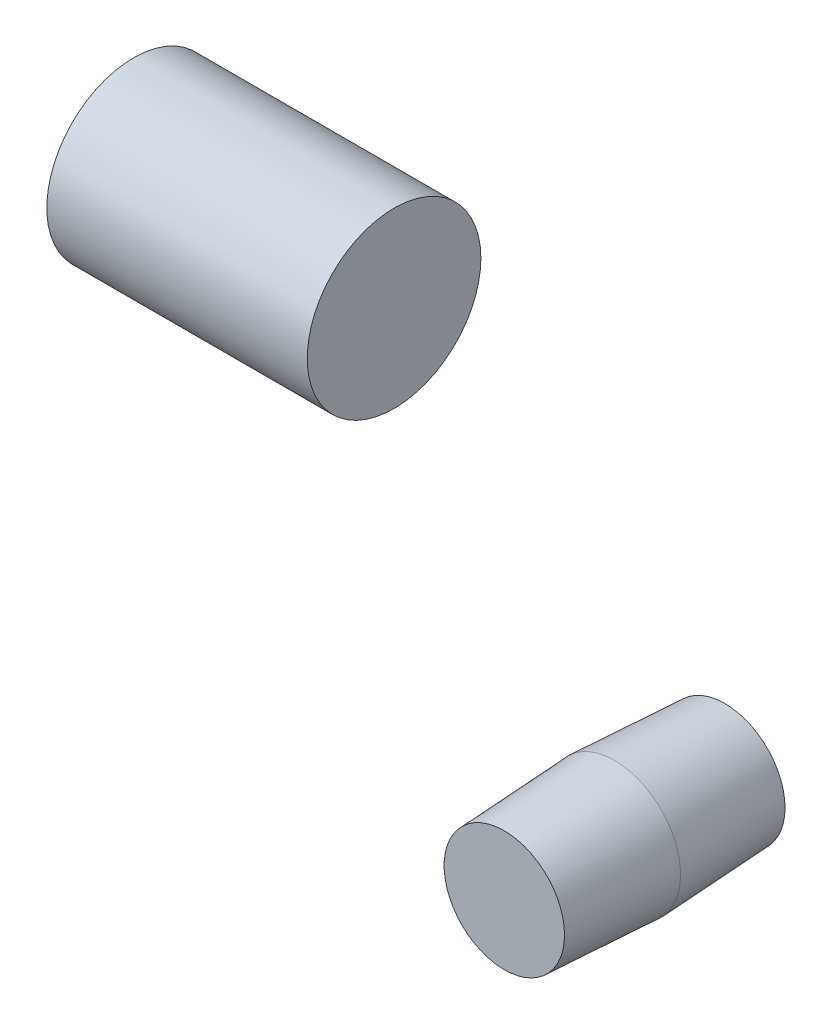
ISO-10303-21;
HEADER;
FILE_DESCRIPTION(('STEP AP214'),'2;1');
FILE_NAME('part.step','',(''),(''),'','','');
FILE_SCHEMA(('AUTOMOTIVE_DESIGN { 1 0 10303 214 1 1 1 1 }'));
ENDSEC;
DATA;
#1=APPLICATION_CONTEXT('core data for automotive mechanical design processes');
#2=APPLICATION_PROTOCOL_DEFINITION('international standard','automotive_design',2000,#1);
#3=PRODUCT_CONTEXT('',#1,'mechanical');
#4=PRODUCT('Part','Part','',(#3));
#5=PRODUCT_RELATED_PRODUCT_CATEGORY('part','',(#4));
#6=PRODUCT_DEFINITION_FORMATION('','',#4);
#7=PRODUCT_DEFINITION_CONTEXT('part definition',#1,'design');
#8=PRODUCT_DEFINITION('design','',#6,#7);
#9=PRODUCT_DEFINITION_SHAPE('','',#8);
#10=(LENGTH_UNIT() NAMED_UNIT(*) SI_UNIT(.MILLI.,.METRE.));
#11=(NAMED_UNIT(*) PLANE_ANGLE_UNIT() SI_UNIT($,.RADIAN.));
#12=(NAMED_UNIT(*) SI_UNIT($,.STERADIAN.) SOLID_ANGLE_UNIT());
#13=UNCERTAINTY_MEASURE_WITH_UNIT(LENGTH_MEASURE(1.E-05),#10,'distance_accuracy_value','');
#14=(GEOMETRIC_REPRESENTATION_CONTEXT(3) GLOBAL_UNCERTAINTY_ASSIGNED_CONTEXT((#13)) GLOBAL_UNIT_ASSIGNED_CONTEXT((#10,
#11,#12)) REPRESENTATION_CONTEXT('',''));
#15=CARTESIAN_POINT('',(0.,0.,0.));
#16=DIRECTION('',(0.,0.,1.));
#17=DIRECTION('',(1.,0.,0.));
#18=AXIS2_PLACEMENT_3D('',#15,#16,#17);
#19=CARTESIAN_POINT('',(-138.5,100.,0.));
#20=DIRECTION('',(1.,0.,0.));
#21=DIRECTION('',(0.,0.,-1.));
#22=AXIS2_PLACEMENT_3D('',#19,#20,#21);
#23=CYLINDRICAL_SURFACE('',#22,25.);
#24=CARTESIAN_POINT('',(-138.5,100.,0.));
#25=DIRECTION('',(1.,0.,0.));
#26=DIRECTION('',(0.,0.,-1.));
#27=AXIS2_PLACEMENT_3D('',#24,#25,#26);
#28=CIRCLE('',#27,25.);
#29=CARTESIAN_POINT('',(-138.5,100.,-25.));
#30=VERTEX_POINT('',#29);
#31=EDGE_CURVE('E11',#30,#30,#28,.T.);
#32=ORIENTED_EDGE('',*,*,#31,.T.);
#33=EDGE_LOOP('',(#32));
#34=FACE_BOUND('',#33,.T.);
#35=CARTESIAN_POINT('',(-63.5,100.,0.));
#36=DIRECTION('',(1.,0.,0.));
#37=DIRECTION('',(0.,0.,-1.));
#38=AXIS2_PLACEMENT_3D('',#35,#36,#37);
#39=CIRCLE('',#38,25.);
#40=CARTESIAN_POINT('',(-63.5,100.,-25.));
#41=VERTEX_POINT('',#40);
#42=EDGE_CURVE('E41',#41,#41,#39,.T.);
#43=ORIENTED_EDGE('',*,*,#42,.F.);
#44=EDGE_LOOP('',(#43));
#45=FACE_BOUND('',#44,.T.);
#46=ADVANCED_FACE('F38',(#34,#45),#23,.T.);
#47=CARTESIAN_POINT('',(-138.5,100.,0.));
#48=DIRECTION('',(1.,0.,0.));
#49=DIRECTION('',(0.,0.,-1.));
#50=AXIS2_PLACEMENT_3D('',#47,#48,#49);
#51=PLANE('',#50);
#52=ORIENTED_EDGE('',*,*,#31,.F.);
#53=EDGE_LOOP('',(#52));
#54=FACE_BOUND('',#53,.T.);
#55=ADVANCED_FACE('F53',(#54),#51,.F.);
#56=CARTESIAN_POINT('',(-63.5,100.,0.));
#57=DIRECTION('',(1.,0.,0.));
#58=DIRECTION('',(0.,0.,-1.));
#59=AXIS2_PLACEMENT_3D('',#56,#57,#58);
#60=PLANE('',#59);
#61=ORIENTED_EDGE('',*,*,#42,.T.);
#62=EDGE_LOOP('',(#61));
#63=FACE_BOUND('',#62,.T.);
#64=ADVANCED_FACE('F50',(#63),#60,.T.);
#65=CLOSED_SHELL('',(#46,#55,#64));
#66=MANIFOLD_SOLID_BREP('B2',#65);
#67=CARTESIAN_POINT('',(0.,0.,0.));
#68=DIRECTION('',(0.,0.,1.));
#69=DIRECTION('',(1.,0.,0.));
#70=AXIS2_PLACEMENT_3D('',#67,#68,#69);
#71=CONICAL_SURFACE('',#70,19.,0.05235987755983);
#72=CARTESIAN_POINT('',(0.,0.,-31.75));
#73=DIRECTION('',(0.,0.,1.));
#74=DIRECTION('',(1.,0.,0.));
#75=AXIS2_PLACEMENT_3D('',#72,#73,#74);
#76=CIRCLE('',#75,17.3360530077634);
#77=CARTESIAN_POINT('',(17.3360530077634,0.,-31.75));
#78=VERTEX_POINT('',#77);
#79=EDGE_CURVE('E37',#78,#78,#76,.T.);
#80=ORIENTED_EDGE('',*,*,#79,.T.);
#81=EDGE_LOOP('',(#80));
#82=FACE_BOUND('',#81,.T.);
#83=CARTESIAN_POINT('',(0.,0.,0.));
#84=DIRECTION('',(0.,0.,1.));
#85=DIRECTION('',(1.,0.,0.));
#86=AXIS2_PLACEMENT_3D('',#83,#84,#85);
#87=CIRCLE('',#86,19.);
#88=CARTESIAN_POINT('',(19.,0.,0.));
#89=VERTEX_POINT('',#88);
#90=EDGE_CURVE('E84',#89,#89,#87,.T.);
#91=ORIENTED_EDGE('',*,*,#90,.F.);
#92=EDGE_LOOP('',(#91));
#93=FACE_BOUND('',#92,.T.);
#94=ADVANCED_FACE('F78',(#82,#93),#71,.T.);
#95=CARTESIAN_POINT('',(0.,0.,-31.75));
#96=DIRECTION('',(0.,0.,1.));
#97=DIRECTION('',(1.,0.,0.));
#98=AXIS2_PLACEMENT_3D('',#95,#96,#97);
#99=PLANE('',#98);
#100=ORIENTED_EDGE('',*,*,#79,.F.);
#101=EDGE_LOOP('',(#100));
#102=FACE_BOUND('',#101,.T.);
#103=ADVANCED_FACE('F99',(#102),#99,.F.);
#104=CARTESIAN_POINT('',(0.,0.,0.));
#105=DIRECTION('',(0.,0.,-1.));
#106=DIRECTION('',(1.,0.,0.));
#107=AXIS2_PLACEMENT_3D('',#104,#105,#106);
#108=CONICAL_SURFACE('',#107,19.,0.05235987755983);
#109=CARTESIAN_POINT('',(0.,0.,31.75));
#110=DIRECTION('',(0.,0.,1.));
#111=DIRECTION('',(1.,0.,0.));
#112=AXIS2_PLACEMENT_3D('',#109,#110,#111);
#113=CIRCLE('',#112,17.3360530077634);
#114=CARTESIAN_POINT('',(17.3360530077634,0.,31.75));
#115=VERTEX_POINT('',#114);
#116=EDGE_CURVE('E88',#115,#115,#113,.T.);
#117=ORIENTED_EDGE('',*,*,#116,.F.);
#118=EDGE_LOOP('',(#117));
#119=FACE_BOUND('',#118,.T.);
#120=ORIENTED_EDGE('',*,*,#90,.T.);
#121=EDGE_LOOP('',(#120));
#122=FACE_BOUND('',#121,.T.);
#123=ADVANCED_FACE('F97',(#119,#122),#108,.T.);
#124=CARTESIAN_POINT('',(0.,0.,31.75));
#125=DIRECTION('',(0.,0.,1.));
#126=DIRECTION('',(1.,0.,0.));
#127=AXIS2_PLACEMENT_3D('',#124,#125,#126);
#128=PLANE('',#127);
#129=ORIENTED_EDGE('',*,*,#116,.T.);
#130=EDGE_LOOP('',(#129));
#131=FACE_BOUND('',#130,.T.);
#132=ADVANCED_FACE('F95',(#131),#128,.T.);
#133=CLOSED_SHELL('',(#94,#103,#123,#132));
#134=MANIFOLD_SOLID_BREP('B6',#133);
#135=ADVANCED_BREP_SHAPE_REPRESENTATION('',(#18,#66,#134),#14);
#136=SHAPE_DEFINITION_REPRESENTATION(#9,#135);
ENDSEC;
END-ISO-10303-21;
